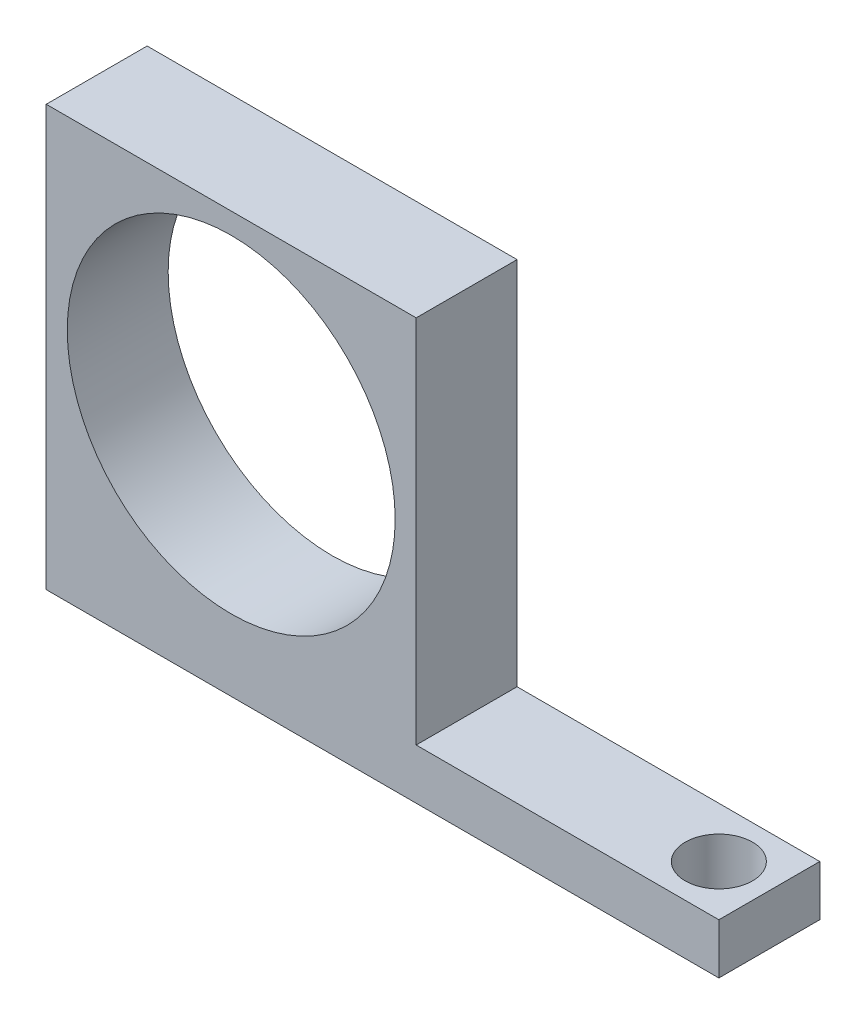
ISO-10303-21;
HEADER;
FILE_DESCRIPTION(('STEP AP214'),'2;1');
FILE_NAME('part.step','',(''),(''),'','','');
FILE_SCHEMA(('AUTOMOTIVE_DESIGN { 1 0 10303 214 1 1 1 1 }'));
ENDSEC;
DATA;
#1=APPLICATION_CONTEXT('core data for automotive mechanical design processes');
#2=APPLICATION_PROTOCOL_DEFINITION('international standard','automotive_design',2000,#1);
#3=PRODUCT_CONTEXT('',#1,'mechanical');
#4=PRODUCT('Part','Part','',(#3));
#5=PRODUCT_RELATED_PRODUCT_CATEGORY('part','',(#4));
#6=PRODUCT_DEFINITION_FORMATION('','',#4);
#7=PRODUCT_DEFINITION_CONTEXT('part definition',#1,'design');
#8=PRODUCT_DEFINITION('design','',#6,#7);
#9=PRODUCT_DEFINITION_SHAPE('','',#8);
#10=(LENGTH_UNIT() NAMED_UNIT(*) SI_UNIT(.MILLI.,.METRE.));
#11=(NAMED_UNIT(*) PLANE_ANGLE_UNIT() SI_UNIT($,.RADIAN.));
#12=(NAMED_UNIT(*) SI_UNIT($,.STERADIAN.) SOLID_ANGLE_UNIT());
#13=UNCERTAINTY_MEASURE_WITH_UNIT(LENGTH_MEASURE(1.E-05),#10,'distance_accuracy_value','');
#14=(GEOMETRIC_REPRESENTATION_CONTEXT(3) GLOBAL_UNCERTAINTY_ASSIGNED_CONTEXT((#13)) GLOBAL_UNIT_ASSIGNED_CONTEXT((#10,
#11,#12)) REPRESENTATION_CONTEXT('',''));
#15=CARTESIAN_POINT('',(0.,0.,0.));
#16=DIRECTION('',(0.,0.,1.));
#17=DIRECTION('',(1.,0.,0.));
#18=AXIS2_PLACEMENT_3D('',#15,#16,#17);
#19=CARTESIAN_POINT('',(0.,3.,0.));
#20=DIRECTION('',(0.,1.,0.));
#21=DIRECTION('',(0.,0.,1.));
#22=AXIS2_PLACEMENT_3D('',#19,#20,#21);
#23=PLANE('',#22);
#24=DIRECTION('',(0.,0.,-1.));
#25=VECTOR('',#24,1.);
#26=CARTESIAN_POINT('',(-18.,3.,-5.99999999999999));
#27=LINE('',#26,#25);
#28=CARTESIAN_POINT('',(-18.,3.,0.));
#29=VERTEX_POINT('',#28);
#30=CARTESIAN_POINT('',(-18.,3.,-5.99999999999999));
#31=VERTEX_POINT('',#30);
#32=EDGE_CURVE('E61',#29,#31,#27,.T.);
#33=ORIENTED_EDGE('',*,*,#32,.F.);
#34=DIRECTION('',(1.,0.,0.));
#35=VECTOR('',#34,1.);
#36=CARTESIAN_POINT('',(0.,3.,0.));
#37=LINE('',#36,#35);
#38=CARTESIAN_POINT('',(0.,3.,0.));
#39=VERTEX_POINT('',#38);
#40=EDGE_CURVE('E66',#29,#39,#37,.T.);
#41=ORIENTED_EDGE('',*,*,#40,.T.);
#42=DIRECTION('',(0.,0.,-1.));
#43=VECTOR('',#42,1.);
#44=CARTESIAN_POINT('',(0.,3.,0.));
#45=LINE('',#44,#43);
#46=CARTESIAN_POINT('',(0.,3.,-6.));
#47=VERTEX_POINT('',#46);
#48=EDGE_CURVE('E98',#39,#47,#45,.T.);
#49=ORIENTED_EDGE('',*,*,#48,.T.);
#50=DIRECTION('',(-1.,0.,0.));
#51=VECTOR('',#50,1.);
#52=CARTESIAN_POINT('',(0.,3.,-6.));
#53=LINE('',#52,#51);
#54=EDGE_CURVE('E170',#47,#31,#53,.T.);
#55=ORIENTED_EDGE('',*,*,#54,.T.);
#56=EDGE_LOOP('',(#33,#41,#49,#55));
#57=FACE_BOUND('',#56,.T.);
#58=CARTESIAN_POINT('',(-3.,3.,-3.));
#59=DIRECTION('',(0.,1.,0.));
#60=DIRECTION('',(0.,0.,1.));
#61=AXIS2_PLACEMENT_3D('',#58,#59,#60);
#62=CIRCLE('',#61,2.);
#63=CARTESIAN_POINT('',(-3.,3.,-1.));
#64=VERTEX_POINT('',#63);
#65=EDGE_CURVE('E111',#64,#64,#62,.T.);
#66=ORIENTED_EDGE('',*,*,#65,.F.);
#67=EDGE_LOOP('',(#66));
#68=FACE_BOUND('',#67,.T.);
#69=ADVANCED_FACE('F45',(#57,#68),#23,.T.);
#70=CARTESIAN_POINT('',(0.,0.,0.));
#71=DIRECTION('',(0.,1.,0.));
#72=DIRECTION('',(0.,0.,1.));
#73=AXIS2_PLACEMENT_3D('',#70,#71,#72);
#74=PLANE('',#73);
#75=DIRECTION('',(0.,0.,-1.));
#76=VECTOR('',#75,1.);
#77=CARTESIAN_POINT('',(0.,0.,0.));
#78=LINE('',#77,#76);
#79=CARTESIAN_POINT('',(0.,0.,0.));
#80=VERTEX_POINT('',#79);
#81=CARTESIAN_POINT('',(0.,0.,-6.));
#82=VERTEX_POINT('',#81);
#83=EDGE_CURVE('E104',#80,#82,#78,.T.);
#84=ORIENTED_EDGE('',*,*,#83,.F.);
#85=DIRECTION('',(1.,0.,0.));
#86=VECTOR('',#85,1.);
#87=CARTESIAN_POINT('',(0.,0.,0.));
#88=LINE('',#87,#86);
#89=CARTESIAN_POINT('',(-40.,0.,0.));
#90=VERTEX_POINT('',#89);
#91=EDGE_CURVE('E86',#90,#80,#88,.T.);
#92=ORIENTED_EDGE('',*,*,#91,.F.);
#93=DIRECTION('',(0.,0.,1.));
#94=VECTOR('',#93,1.);
#95=CARTESIAN_POINT('',(-40.,0.,0.));
#96=LINE('',#95,#94);
#97=CARTESIAN_POINT('',(-40.,0.,-5.99999999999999));
#98=VERTEX_POINT('',#97);
#99=EDGE_CURVE('E99',#98,#90,#96,.T.);
#100=ORIENTED_EDGE('',*,*,#99,.F.);
#101=DIRECTION('',(-1.,0.,0.));
#102=VECTOR('',#101,1.);
#103=CARTESIAN_POINT('',(0.,0.,-6.));
#104=LINE('',#103,#102);
#105=EDGE_CURVE('E109',#82,#98,#104,.T.);
#106=ORIENTED_EDGE('',*,*,#105,.F.);
#107=EDGE_LOOP('',(#84,#92,#100,#106));
#108=FACE_BOUND('',#107,.T.);
#109=CARTESIAN_POINT('',(-3.,0.,-3.));
#110=DIRECTION('',(0.,1.,0.));
#111=DIRECTION('',(0.,0.,1.));
#112=AXIS2_PLACEMENT_3D('',#109,#110,#111);
#113=CIRCLE('',#112,2.);
#114=CARTESIAN_POINT('',(-3.,0.,-1.));
#115=VERTEX_POINT('',#114);
#116=EDGE_CURVE('E117',#115,#115,#113,.T.);
#117=ORIENTED_EDGE('',*,*,#116,.T.);
#118=EDGE_LOOP('',(#117));
#119=FACE_BOUND('',#118,.T.);
#120=ADVANCED_FACE('F107',(#108,#119),#74,.F.);
#121=CARTESIAN_POINT('',(0.,3.,0.));
#122=DIRECTION('',(-1.,0.,0.));
#123=DIRECTION('',(0.,0.,1.));
#124=AXIS2_PLACEMENT_3D('',#121,#122,#123);
#125=PLANE('',#124);
#126=ORIENTED_EDGE('',*,*,#83,.T.);
#127=DIRECTION('',(0.,-1.,0.));
#128=VECTOR('',#127,1.);
#129=CARTESIAN_POINT('',(0.,3.,-6.));
#130=LINE('',#129,#128);
#131=EDGE_CURVE('E11',#47,#82,#130,.T.);
#132=ORIENTED_EDGE('',*,*,#131,.F.);
#133=ORIENTED_EDGE('',*,*,#48,.F.);
#134=DIRECTION('',(0.,-1.,0.));
#135=VECTOR('',#134,1.);
#136=CARTESIAN_POINT('',(0.,3.,0.));
#137=LINE('',#136,#135);
#138=EDGE_CURVE('E89',#39,#80,#137,.T.);
#139=ORIENTED_EDGE('',*,*,#138,.T.);
#140=EDGE_LOOP('',(#126,#132,#133,#139));
#141=FACE_BOUND('',#140,.T.);
#142=ADVANCED_FACE('F47',(#141),#125,.F.);
#143=CARTESIAN_POINT('',(0.,3.,-6.));
#144=DIRECTION('',(0.,0.,1.));
#145=DIRECTION('',(1.,0.,0.));
#146=AXIS2_PLACEMENT_3D('',#143,#144,#145);
#147=PLANE('',#146);
#148=CARTESIAN_POINT('',(-29.,14.,-6.));
#149=DIRECTION('',(0.,0.,-1.));
#150=DIRECTION('',(-1.,0.,0.));
#151=AXIS2_PLACEMENT_3D('',#148,#149,#150);
#152=CIRCLE('',#151,9.75);
#153=CARTESIAN_POINT('',(-38.75,14.,-6.));
#154=VERTEX_POINT('',#153);
#155=EDGE_CURVE('E189',#154,#154,#152,.T.);
#156=ORIENTED_EDGE('',*,*,#155,.F.);
#157=EDGE_LOOP('',(#156));
#158=FACE_BOUND('',#157,.T.);
#159=ORIENTED_EDGE('',*,*,#105,.T.);
#160=DIRECTION('',(0.,-1.,0.));
#161=VECTOR('',#160,1.);
#162=CARTESIAN_POINT('',(-40.,3.,-5.99999999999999));
#163=LINE('',#162,#161);
#164=CARTESIAN_POINT('',(-40.,25.,-5.99999999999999));
#165=VERTEX_POINT('',#164);
#166=EDGE_CURVE('E54',#165,#98,#163,.T.);
#167=ORIENTED_EDGE('',*,*,#166,.F.);
#168=DIRECTION('',(-1.,0.,0.));
#169=VECTOR('',#168,1.);
#170=CARTESIAN_POINT('',(-40.,25.,-5.99999999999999));
#171=LINE('',#170,#169);
#172=CARTESIAN_POINT('',(-18.,25.,-5.99999999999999));
#173=VERTEX_POINT('',#172);
#174=EDGE_CURVE('E139',#173,#165,#171,.T.);
#175=ORIENTED_EDGE('',*,*,#174,.F.);
#176=DIRECTION('',(0.,-1.,0.));
#177=VECTOR('',#176,1.);
#178=CARTESIAN_POINT('',(-18.,25.,-5.99999999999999));
#179=LINE('',#178,#177);
#180=EDGE_CURVE('E150',#173,#31,#179,.T.);
#181=ORIENTED_EDGE('',*,*,#180,.T.);
#182=ORIENTED_EDGE('',*,*,#54,.F.);
#183=ORIENTED_EDGE('',*,*,#131,.T.);
#184=EDGE_LOOP('',(#159,#167,#175,#181,#182,#183));
#185=FACE_BOUND('',#184,.T.);
#186=ADVANCED_FACE('F136',(#158,#185),#147,.F.);
#187=CARTESIAN_POINT('',(-40.,3.,0.));
#188=DIRECTION('',(1.,0.,0.));
#189=DIRECTION('',(0.,0.,-1.));
#190=AXIS2_PLACEMENT_3D('',#187,#188,#189);
#191=PLANE('',#190);
#192=ORIENTED_EDGE('',*,*,#99,.T.);
#193=DIRECTION('',(0.,-1.,0.));
#194=VECTOR('',#193,1.);
#195=CARTESIAN_POINT('',(-40.,3.,0.));
#196=LINE('',#195,#194);
#197=CARTESIAN_POINT('',(-40.,25.,0.));
#198=VERTEX_POINT('',#197);
#199=EDGE_CURVE('E93',#198,#90,#196,.T.);
#200=ORIENTED_EDGE('',*,*,#199,.F.);
#201=DIRECTION('',(0.,0.,1.));
#202=VECTOR('',#201,1.);
#203=CARTESIAN_POINT('',(-40.,25.,-5.99999999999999));
#204=LINE('',#203,#202);
#205=EDGE_CURVE('E132',#165,#198,#204,.T.);
#206=ORIENTED_EDGE('',*,*,#205,.F.);
#207=ORIENTED_EDGE('',*,*,#166,.T.);
#208=EDGE_LOOP('',(#192,#200,#206,#207));
#209=FACE_BOUND('',#208,.T.);
#210=ADVANCED_FACE('F130',(#209),#191,.F.);
#211=CARTESIAN_POINT('',(0.,3.,0.));
#212=DIRECTION('',(0.,0.,-1.));
#213=DIRECTION('',(-1.,0.,0.));
#214=AXIS2_PLACEMENT_3D('',#211,#212,#213);
#215=PLANE('',#214);
#216=CARTESIAN_POINT('',(-29.,14.,0.));
#217=DIRECTION('',(0.,0.,-1.));
#218=DIRECTION('',(-1.,0.,0.));
#219=AXIS2_PLACEMENT_3D('',#216,#217,#218);
#220=CIRCLE('',#219,9.75);
#221=CARTESIAN_POINT('',(-38.75,14.,0.));
#222=VERTEX_POINT('',#221);
#223=EDGE_CURVE('E161',#222,#222,#220,.F.);
#224=ORIENTED_EDGE('',*,*,#223,.F.);
#225=EDGE_LOOP('',(#224));
#226=FACE_BOUND('',#225,.T.);
#227=ORIENTED_EDGE('',*,*,#91,.T.);
#228=ORIENTED_EDGE('',*,*,#138,.F.);
#229=ORIENTED_EDGE('',*,*,#40,.F.);
#230=DIRECTION('',(0.,-1.,0.));
#231=VECTOR('',#230,1.);
#232=CARTESIAN_POINT('',(-18.,25.,0.));
#233=LINE('',#232,#231);
#234=CARTESIAN_POINT('',(-18.,25.,0.));
#235=VERTEX_POINT('',#234);
#236=EDGE_CURVE('E154',#235,#29,#233,.T.);
#237=ORIENTED_EDGE('',*,*,#236,.F.);
#238=DIRECTION('',(1.,0.,0.));
#239=VECTOR('',#238,1.);
#240=CARTESIAN_POINT('',(-40.,25.,0.));
#241=LINE('',#240,#239);
#242=EDGE_CURVE('E156',#198,#235,#241,.T.);
#243=ORIENTED_EDGE('',*,*,#242,.F.);
#244=ORIENTED_EDGE('',*,*,#199,.T.);
#245=EDGE_LOOP('',(#227,#228,#229,#237,#243,#244));
#246=FACE_BOUND('',#245,.T.);
#247=ADVANCED_FACE('F88',(#226,#246),#215,.F.);
#248=CARTESIAN_POINT('',(-3.,3.,-3.));
#249=DIRECTION('',(0.,-1.,0.));
#250=DIRECTION('',(0.,0.,-1.));
#251=AXIS2_PLACEMENT_3D('',#248,#249,#250);
#252=CYLINDRICAL_SURFACE('',#251,2.);
#253=ORIENTED_EDGE('',*,*,#65,.T.);
#254=EDGE_LOOP('',(#253));
#255=FACE_BOUND('',#254,.T.);
#256=ORIENTED_EDGE('',*,*,#116,.F.);
#257=EDGE_LOOP('',(#256));
#258=FACE_BOUND('',#257,.T.);
#259=ADVANCED_FACE('F213',(#255,#258),#252,.F.);
#260=CARTESIAN_POINT('',(-18.,25.,-5.99999999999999));
#261=DIRECTION('',(-1.,0.,0.));
#262=DIRECTION('',(0.,0.,1.));
#263=AXIS2_PLACEMENT_3D('',#260,#261,#262);
#264=PLANE('',#263);
#265=ORIENTED_EDGE('',*,*,#32,.T.);
#266=ORIENTED_EDGE('',*,*,#180,.F.);
#267=DIRECTION('',(0.,0.,-1.));
#268=VECTOR('',#267,1.);
#269=CARTESIAN_POINT('',(-18.,25.,-5.99999999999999));
#270=LINE('',#269,#268);
#271=EDGE_CURVE('E147',#235,#173,#270,.T.);
#272=ORIENTED_EDGE('',*,*,#271,.F.);
#273=ORIENTED_EDGE('',*,*,#236,.T.);
#274=EDGE_LOOP('',(#265,#266,#272,#273));
#275=FACE_BOUND('',#274,.T.);
#276=ADVANCED_FACE('F176',(#275),#264,.F.);
#277=CARTESIAN_POINT('',(0.,25.,0.));
#278=DIRECTION('',(0.,1.,0.));
#279=DIRECTION('',(0.,0.,1.));
#280=AXIS2_PLACEMENT_3D('',#277,#278,#279);
#281=PLANE('',#280);
#282=ORIENTED_EDGE('',*,*,#205,.T.);
#283=ORIENTED_EDGE('',*,*,#242,.T.);
#284=ORIENTED_EDGE('',*,*,#271,.T.);
#285=ORIENTED_EDGE('',*,*,#174,.T.);
#286=EDGE_LOOP('',(#282,#283,#284,#285));
#287=FACE_BOUND('',#286,.T.);
#288=ADVANCED_FACE('F143',(#287),#281,.T.);
#289=CARTESIAN_POINT('',(-29.,14.,0.00100000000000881));
#290=DIRECTION('',(0.,0.,-1.));
#291=DIRECTION('',(-1.,0.,0.));
#292=AXIS2_PLACEMENT_3D('',#289,#290,#291);
#293=CYLINDRICAL_SURFACE('',#292,9.75);
#294=CARTESIAN_POINT('',(-38.75,14.,-6.));
#295=CARTESIAN_POINT('',(-38.75,14.,-5.9375));
#296=CARTESIAN_POINT('',(-38.75,14.,-5.875));
#297=CARTESIAN_POINT('',(-38.75,14.,-5.75));
#298=CARTESIAN_POINT('',(-38.75,14.,-5.6875));
#299=CARTESIAN_POINT('',(-38.75,14.,-5.5625));
#300=CARTESIAN_POINT('',(-38.75,14.,-5.5));
#301=CARTESIAN_POINT('',(-38.75,14.,-5.375));
#302=CARTESIAN_POINT('',(-38.75,14.,-5.3125));
#303=CARTESIAN_POINT('',(-38.75,14.,-5.1875));
#304=CARTESIAN_POINT('',(-38.75,14.,-5.125));
#305=CARTESIAN_POINT('',(-38.75,14.,-5.));
#306=CARTESIAN_POINT('',(-38.75,14.,-4.9375));
#307=CARTESIAN_POINT('',(-38.75,14.,-4.8125));
#308=CARTESIAN_POINT('',(-38.75,14.,-4.75));
#309=CARTESIAN_POINT('',(-38.75,14.,-4.625));
#310=CARTESIAN_POINT('',(-38.75,14.,-4.5625));
#311=CARTESIAN_POINT('',(-38.75,14.,-4.4375));
#312=CARTESIAN_POINT('',(-38.75,14.,-4.375));
#313=CARTESIAN_POINT('',(-38.75,14.,-4.25));
#314=CARTESIAN_POINT('',(-38.75,14.,-4.1875));
#315=CARTESIAN_POINT('',(-38.75,14.,-4.0625));
#316=CARTESIAN_POINT('',(-38.75,14.,-4.));
#317=CARTESIAN_POINT('',(-38.75,14.,-3.875));
#318=CARTESIAN_POINT('',(-38.75,14.,-3.8125));
#319=CARTESIAN_POINT('',(-38.75,14.,-3.6875));
#320=CARTESIAN_POINT('',(-38.75,14.,-3.625));
#321=CARTESIAN_POINT('',(-38.75,14.,-3.5));
#322=CARTESIAN_POINT('',(-38.75,14.,-3.4375));
#323=CARTESIAN_POINT('',(-38.75,14.,-3.3125));
#324=CARTESIAN_POINT('',(-38.75,14.,-3.25));
#325=CARTESIAN_POINT('',(-38.75,14.,-3.125));
#326=CARTESIAN_POINT('',(-38.75,14.,-3.0625));
#327=CARTESIAN_POINT('',(-38.75,14.,-2.9375));
#328=CARTESIAN_POINT('',(-38.75,14.,-2.875));
#329=CARTESIAN_POINT('',(-38.75,14.,-2.75));
#330=CARTESIAN_POINT('',(-38.75,14.,-2.6875));
#331=CARTESIAN_POINT('',(-38.75,14.,-2.5625));
#332=CARTESIAN_POINT('',(-38.75,14.,-2.5));
#333=CARTESIAN_POINT('',(-38.75,14.,-2.375));
#334=CARTESIAN_POINT('',(-38.75,14.,-2.3125));
#335=CARTESIAN_POINT('',(-38.75,14.,-2.1875));
#336=CARTESIAN_POINT('',(-38.75,14.,-2.125));
#337=CARTESIAN_POINT('',(-38.75,14.,-1.99999999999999));
#338=CARTESIAN_POINT('',(-38.75,14.,-1.93749999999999));
#339=CARTESIAN_POINT('',(-38.75,14.,-1.8125));
#340=CARTESIAN_POINT('',(-38.75,14.,-1.75));
#341=CARTESIAN_POINT('',(-38.75,14.,-1.625));
#342=CARTESIAN_POINT('',(-38.75,14.,-1.5625));
#343=CARTESIAN_POINT('',(-38.75,14.,-1.4375));
#344=CARTESIAN_POINT('',(-38.75,14.,-1.375));
#345=CARTESIAN_POINT('',(-38.75,14.,-1.25));
#346=CARTESIAN_POINT('',(-38.75,14.,-1.1875));
#347=CARTESIAN_POINT('',(-38.75,14.,-1.0625));
#348=CARTESIAN_POINT('',(-38.75,14.,-0.999999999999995));
#349=CARTESIAN_POINT('',(-38.75,14.,-0.874999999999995));
#350=CARTESIAN_POINT('',(-38.75,14.,-0.812499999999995));
#351=CARTESIAN_POINT('',(-38.75,14.,-0.687499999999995));
#352=CARTESIAN_POINT('',(-38.75,14.,-0.624999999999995));
#353=CARTESIAN_POINT('',(-38.75,14.,-0.499999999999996));
#354=CARTESIAN_POINT('',(-38.75,14.,-0.437499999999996));
#355=CARTESIAN_POINT('',(-38.75,14.,-0.312499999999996));
#356=CARTESIAN_POINT('',(-38.75,14.,-0.249999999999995));
#357=CARTESIAN_POINT('',(-38.75,14.,-0.124999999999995));
#358=CARTESIAN_POINT('',(-38.75,14.,-0.0624999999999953));
#359=CARTESIAN_POINT('',(-38.75,14.,0.));
#360=B_SPLINE_CURVE_WITH_KNOTS('',3,(#294,#295,#296,#297,#298,#299,#300,#301,#302,#303,#304,
#305,#306,#307,#308,#309,#310,#311,#312,#313,#314,#315,#316,#317,#318,#319,#320,#321,#322,#323,
#324,#325,#326,#327,#328,#329,#330,#331,#332,#333,#334,#335,#336,#337,#338,#339,#340,#341,#342,
#343,#344,#345,#346,#347,#348,#349,#350,#351,#352,#353,#354,#355,#356,#357,#358,#359),
.UNSPECIFIED.,.F.,.F.,(4,2,2,2,2,2,2,2,2,2,2,2,2,2,2,2,2,2,2,2,2,2,2,2,2,2,2,2,2,2,2,2,4),(0.,
0.1875,0.375,0.5625,0.75,0.9375,1.125,1.3125,1.5,1.6875,1.875,2.0625,2.25,2.4375,2.625,2.8125,
3.,3.1875,3.375,3.5625,3.75,3.9375,4.125,4.3125,4.5,4.6875,4.875,5.0625,5.25,5.4375,5.625,
5.8125,6.),.UNSPECIFIED.);
#361=EDGE_CURVE('BSEAM194',#154,#222,#360,.T.);
#362=ORIENTED_EDGE('',*,*,#155,.T.);
#363=ORIENTED_EDGE('',*,*,#223,.T.);
#364=ORIENTED_EDGE('',*,*,#361,.T.);
#365=ORIENTED_EDGE('',*,*,#361,.F.);
#366=EDGE_LOOP('',(#362,#364,#363,#365));
#367=FACE_BOUND('',#366,.T.);
#368=ADVANCED_FACE('F194',(#367),#293,.F.);
#369=CLOSED_SHELL('',(#69,#120,#142,#186,#210,#247,#259,#276,#288,#368));
#370=MANIFOLD_SOLID_BREP('B2',#369);
#371=ADVANCED_BREP_SHAPE_REPRESENTATION('',(#18,#370),#14);
#372=SHAPE_DEFINITION_REPRESENTATION(#9,#371);
ENDSEC;
END-ISO-10303-21;
